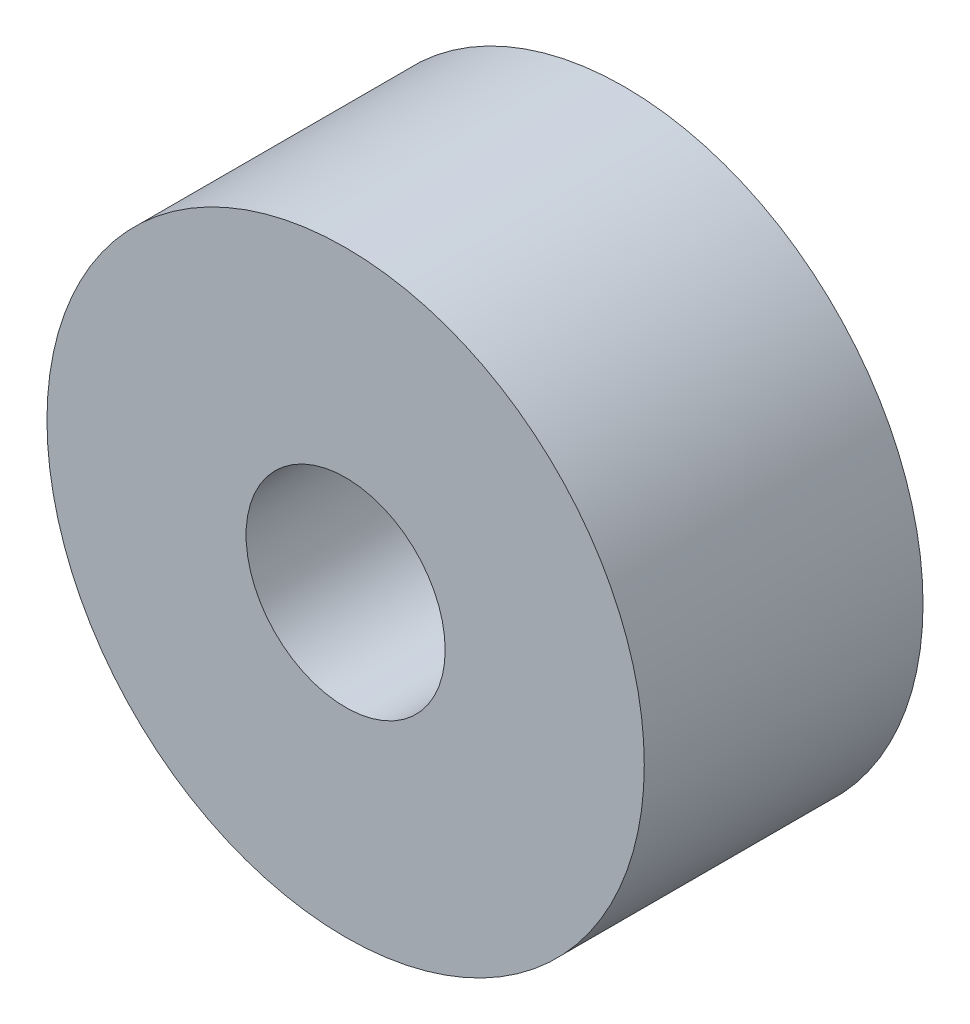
from build123d import *

# Parameters (mm, degrees)
ESQUISSE1_R          = 15
ESQUISSE1_R_2        = 5
BASE_EXTRUSION_DEPTH = 7


with BuildPart() as part:
    # Esquisse1 → Base-Extrusion (new, symmetric)
    with BuildSketch(Plane.XY):
        Circle(ESQUISSE1_R)
        Circle(ESQUISSE1_R_2, mode=Mode.SUBTRACT)
    extrude(amount=BASE_EXTRUSION_DEPTH, both=True)


solid = part.part
